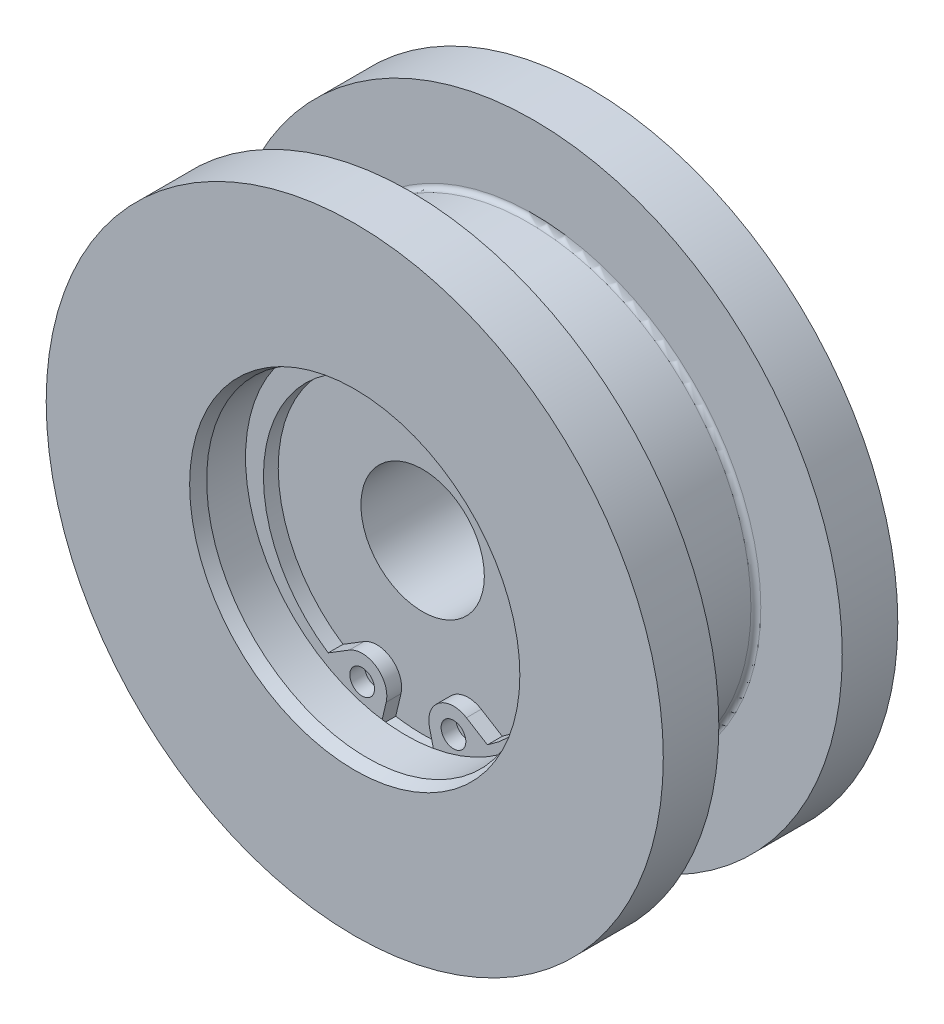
ISO-10303-21;
HEADER;
FILE_DESCRIPTION(('STEP AP214'),'2;1');
FILE_NAME('part.step','',(''),(''),'','','');
FILE_SCHEMA(('AUTOMOTIVE_DESIGN { 1 0 10303 214 1 1 1 1 }'));
ENDSEC;
DATA;
#1=APPLICATION_CONTEXT('core data for automotive mechanical design processes');
#2=APPLICATION_PROTOCOL_DEFINITION('international standard','automotive_design',2000,#1);
#3=PRODUCT_CONTEXT('',#1,'mechanical');
#4=PRODUCT('Part','Part','',(#3));
#5=PRODUCT_RELATED_PRODUCT_CATEGORY('part','',(#4));
#6=PRODUCT_DEFINITION_FORMATION('','',#4);
#7=PRODUCT_DEFINITION_CONTEXT('part definition',#1,'design');
#8=PRODUCT_DEFINITION('design','',#6,#7);
#9=PRODUCT_DEFINITION_SHAPE('','',#8);
#10=(LENGTH_UNIT() NAMED_UNIT(*) SI_UNIT(.MILLI.,.METRE.));
#11=(NAMED_UNIT(*) PLANE_ANGLE_UNIT() SI_UNIT($,.RADIAN.));
#12=(NAMED_UNIT(*) SI_UNIT($,.STERADIAN.) SOLID_ANGLE_UNIT());
#13=UNCERTAINTY_MEASURE_WITH_UNIT(LENGTH_MEASURE(1.E-05),#10,'distance_accuracy_value','');
#14=(GEOMETRIC_REPRESENTATION_CONTEXT(3) GLOBAL_UNCERTAINTY_ASSIGNED_CONTEXT((#13)) GLOBAL_UNIT_ASSIGNED_CONTEXT((#10,
#11,#12)) REPRESENTATION_CONTEXT('',''));
#15=CARTESIAN_POINT('',(0.,0.,0.));
#16=DIRECTION('',(0.,0.,1.));
#17=DIRECTION('',(1.,0.,0.));
#18=AXIS2_PLACEMENT_3D('',#15,#16,#17);
#19=CARTESIAN_POINT('',(0.,0.,-4.6));
#20=DIRECTION('',(0.,0.,1.));
#21=DIRECTION('',(0.,-1.,0.));
#22=AXIS2_PLACEMENT_3D('',#19,#20,#21);
#23=CYLINDRICAL_SURFACE('',#22,18.);
#24=CARTESIAN_POINT('',(0.,0.,4.6));
#25=DIRECTION('',(0.,0.,-1.));
#26=DIRECTION('',(-1.,0.,0.));
#27=AXIS2_PLACEMENT_3D('',#24,#25,#26);
#28=CIRCLE('',#27,18.);
#29=CARTESIAN_POINT('',(-18.,0.,4.6));
#30=VERTEX_POINT('',#29);
#31=EDGE_CURVE('E203',#30,#30,#28,.T.);
#32=ORIENTED_EDGE('',*,*,#31,.T.);
#33=EDGE_LOOP('',(#32));
#34=FACE_BOUND('',#33,.T.);
#35=CARTESIAN_POINT('',(0.,0.,-4.6));
#36=DIRECTION('',(0.,0.,1.));
#37=DIRECTION('',(1.,0.,0.));
#38=AXIS2_PLACEMENT_3D('',#35,#36,#37);
#39=CIRCLE('',#38,18.);
#40=CARTESIAN_POINT('',(18.,0.,-4.6));
#41=VERTEX_POINT('',#40);
#42=EDGE_CURVE('E199',#41,#41,#39,.T.);
#43=ORIENTED_EDGE('',*,*,#42,.T.);
#44=EDGE_LOOP('',(#43));
#45=FACE_BOUND('',#44,.T.);
#46=ADVANCED_FACE('F14',(#34,#45),#23,.T.);
#47=CARTESIAN_POINT('',(0.,0.,-4.6));
#48=DIRECTION('',(0.,0.,1.));
#49=DIRECTION('',(1.,0.,0.));
#50=AXIS2_PLACEMENT_3D('',#47,#48,#49);
#51=TOROIDAL_SURFACE('',#50,18.4,0.4);
#52=ORIENTED_EDGE('',*,*,#42,.F.);
#53=EDGE_LOOP('',(#52));
#54=FACE_BOUND('',#53,.T.);
#55=CARTESIAN_POINT('',(0.,0.,-5.));
#56=DIRECTION('',(0.,0.,1.));
#57=DIRECTION('',(1.,0.,0.));
#58=AXIS2_PLACEMENT_3D('',#55,#56,#57);
#59=CIRCLE('',#58,18.4);
#60=CARTESIAN_POINT('',(18.4,0.,-5.));
#61=VERTEX_POINT('',#60);
#62=EDGE_CURVE('E193',#61,#61,#59,.F.);
#63=ORIENTED_EDGE('',*,*,#62,.F.);
#64=EDGE_LOOP('',(#63));
#65=FACE_BOUND('',#64,.T.);
#66=ADVANCED_FACE('F266',(#54,#65),#51,.F.);
#67=CARTESIAN_POINT('',(0.,0.,4.6));
#68=DIRECTION('',(0.,0.,1.));
#69=DIRECTION('',(1.,0.,0.));
#70=AXIS2_PLACEMENT_3D('',#67,#68,#69);
#71=TOROIDAL_SURFACE('',#70,18.4,0.4);
#72=CARTESIAN_POINT('',(0.,0.,5.));
#73=DIRECTION('',(0.,0.,1.));
#74=DIRECTION('',(1.,0.,0.));
#75=AXIS2_PLACEMENT_3D('',#72,#73,#74);
#76=CIRCLE('',#75,18.4000000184);
#77=CARTESIAN_POINT('',(18.4000000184,0.,5.));
#78=VERTEX_POINT('',#77);
#79=EDGE_CURVE('E204',#78,#78,#76,.F.);
#80=ORIENTED_EDGE('',*,*,#79,.T.);
#81=EDGE_LOOP('',(#80));
#82=FACE_BOUND('',#81,.T.);
#83=ORIENTED_EDGE('',*,*,#31,.F.);
#84=EDGE_LOOP('',(#83));
#85=FACE_BOUND('',#84,.T.);
#86=ADVANCED_FACE('F260',(#82,#85),#71,.F.);
#87=CARTESIAN_POINT('',(25.3,-25.387056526,-5.));
#88=DIRECTION('',(0.,0.,-1.));
#89=DIRECTION('',(-1.,0.,0.));
#90=AXIS2_PLACEMENT_3D('',#87,#88,#89);
#91=PLANE('',#90);
#92=ORIENTED_EDGE('',*,*,#62,.T.);
#93=EDGE_LOOP('',(#92));
#94=FACE_BOUND('',#93,.T.);
#95=CARTESIAN_POINT('',(0.,0.,-5.));
#96=DIRECTION('',(0.,0.,1.));
#97=DIRECTION('',(1.,0.,0.));
#98=AXIS2_PLACEMENT_3D('',#95,#96,#97);
#99=CIRCLE('',#98,25.);
#100=CARTESIAN_POINT('',(25.,0.,-5.));
#101=VERTEX_POINT('',#100);
#102=EDGE_CURVE('E188',#101,#101,#99,.F.);
#103=ORIENTED_EDGE('',*,*,#102,.F.);
#104=EDGE_LOOP('',(#103));
#105=FACE_BOUND('',#104,.T.);
#106=ADVANCED_FACE('F249',(#94,#105),#91,.F.);
#107=CARTESIAN_POINT('',(-25.3,-25.387056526,5.));
#108=DIRECTION('',(0.,0.,1.));
#109=DIRECTION('',(1.,0.,0.));
#110=AXIS2_PLACEMENT_3D('',#107,#108,#109);
#111=PLANE('',#110);
#112=ORIENTED_EDGE('',*,*,#79,.F.);
#113=EDGE_LOOP('',(#112));
#114=FACE_BOUND('',#113,.T.);
#115=CARTESIAN_POINT('',(0.,0.,5.));
#116=DIRECTION('',(0.,0.,1.));
#117=DIRECTION('',(1.,0.,0.));
#118=AXIS2_PLACEMENT_3D('',#115,#116,#117);
#119=CIRCLE('',#118,25.);
#120=CARTESIAN_POINT('',(25.,0.,5.));
#121=VERTEX_POINT('',#120);
#122=EDGE_CURVE('E211',#121,#121,#119,.T.);
#123=ORIENTED_EDGE('',*,*,#122,.F.);
#124=EDGE_LOOP('',(#123));
#125=FACE_BOUND('',#124,.T.);
#126=ADVANCED_FACE('F247',(#114,#125),#111,.F.);
#127=CARTESIAN_POINT('',(0.,0.,-9.5));
#128=DIRECTION('',(0.,0.,1.));
#129=DIRECTION('',(1.,0.,0.));
#130=AXIS2_PLACEMENT_3D('',#127,#128,#129);
#131=CYLINDRICAL_SURFACE('',#130,25.);
#132=ORIENTED_EDGE('',*,*,#102,.T.);
#133=EDGE_LOOP('',(#132));
#134=FACE_BOUND('',#133,.T.);
#135=CARTESIAN_POINT('',(0.,0.,-9.5));
#136=DIRECTION('',(0.,0.,1.));
#137=DIRECTION('',(1.,0.,0.));
#138=AXIS2_PLACEMENT_3D('',#135,#136,#137);
#139=CIRCLE('',#138,25.);
#140=CARTESIAN_POINT('',(25.,0.,-9.5));
#141=VERTEX_POINT('',#140);
#142=EDGE_CURVE('E182',#141,#141,#139,.T.);
#143=ORIENTED_EDGE('',*,*,#142,.T.);
#144=EDGE_LOOP('',(#143));
#145=FACE_BOUND('',#144,.T.);
#146=ADVANCED_FACE('F243',(#134,#145),#131,.T.);
#147=CARTESIAN_POINT('',(0.,0.,5.));
#148=DIRECTION('',(0.,0.,1.));
#149=DIRECTION('',(1.,0.,0.));
#150=AXIS2_PLACEMENT_3D('',#147,#148,#149);
#151=CYLINDRICAL_SURFACE('',#150,25.);
#152=CARTESIAN_POINT('',(0.,0.,9.5));
#153=DIRECTION('',(0.,0.,1.));
#154=DIRECTION('',(1.,0.,0.));
#155=AXIS2_PLACEMENT_3D('',#152,#153,#154);
#156=CIRCLE('',#155,25.);
#157=CARTESIAN_POINT('',(25.,0.,9.5));
#158=VERTEX_POINT('',#157);
#159=EDGE_CURVE('E172',#158,#158,#156,.F.);
#160=ORIENTED_EDGE('',*,*,#159,.T.);
#161=EDGE_LOOP('',(#160));
#162=FACE_BOUND('',#161,.T.);
#163=ORIENTED_EDGE('',*,*,#122,.T.);
#164=EDGE_LOOP('',(#163));
#165=FACE_BOUND('',#164,.T.);
#166=ADVANCED_FACE('F240',(#162,#165),#151,.T.);
#167=CARTESIAN_POINT('',(-25.3,-25.387056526,-9.5));
#168=DIRECTION('',(0.,0.,1.));
#169=DIRECTION('',(1.,0.,0.));
#170=AXIS2_PLACEMENT_3D('',#167,#168,#169);
#171=PLANE('',#170);
#172=CARTESIAN_POINT('',(0.,0.,-9.5));
#173=DIRECTION('',(0.,0.,1.));
#174=DIRECTION('',(1.,0.,0.));
#175=AXIS2_PLACEMENT_3D('',#172,#173,#174);
#176=CIRCLE('',#175,11.);
#177=CARTESIAN_POINT('',(11.,0.,-9.5));
#178=VERTEX_POINT('',#177);
#179=EDGE_CURVE('E176',#178,#178,#176,.F.);
#180=ORIENTED_EDGE('',*,*,#179,.F.);
#181=EDGE_LOOP('',(#180));
#182=FACE_BOUND('',#181,.T.);
#183=ORIENTED_EDGE('',*,*,#142,.F.);
#184=EDGE_LOOP('',(#183));
#185=FACE_BOUND('',#184,.T.);
#186=ADVANCED_FACE('F236',(#182,#185),#171,.F.);
#187=CARTESIAN_POINT('',(25.3,-25.387056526,9.5));
#188=DIRECTION('',(0.,0.,-1.));
#189=DIRECTION('',(-1.,0.,0.));
#190=AXIS2_PLACEMENT_3D('',#187,#188,#189);
#191=PLANE('',#190);
#192=CARTESIAN_POINT('',(0.,0.,9.5));
#193=DIRECTION('',(0.,0.,1.));
#194=DIRECTION('',(1.,0.,0.));
#195=AXIS2_PLACEMENT_3D('',#192,#193,#194);
#196=CIRCLE('',#195,13.377350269);
#197=CARTESIAN_POINT('',(13.377350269,0.,9.5));
#198=VERTEX_POINT('',#197);
#199=EDGE_CURVE('E207',#198,#198,#196,.T.);
#200=ORIENTED_EDGE('',*,*,#199,.F.);
#201=EDGE_LOOP('',(#200));
#202=FACE_BOUND('',#201,.T.);
#203=ORIENTED_EDGE('',*,*,#159,.F.);
#204=EDGE_LOOP('',(#203));
#205=FACE_BOUND('',#204,.T.);
#206=ADVANCED_FACE('F233',(#202,#205),#191,.F.);
#207=CARTESIAN_POINT('',(0.,0.,-9.5));
#208=DIRECTION('',(0.,0.,1.));
#209=DIRECTION('',(1.,0.,0.));
#210=AXIS2_PLACEMENT_3D('',#207,#208,#209);
#211=CYLINDRICAL_SURFACE('',#210,11.);
#212=ORIENTED_EDGE('',*,*,#179,.T.);
#213=EDGE_LOOP('',(#212));
#214=FACE_BOUND('',#213,.T.);
#215=CARTESIAN_POINT('',(0.,0.,-4.));
#216=DIRECTION('',(0.,0.,1.));
#217=DIRECTION('',(1.,0.,0.));
#218=AXIS2_PLACEMENT_3D('',#215,#216,#217);
#219=CIRCLE('',#218,11.);
#220=CARTESIAN_POINT('',(11.,0.,-4.));
#221=VERTEX_POINT('',#220);
#222=EDGE_CURVE('E173',#221,#221,#219,.T.);
#223=ORIENTED_EDGE('',*,*,#222,.T.);
#224=EDGE_LOOP('',(#223));
#225=FACE_BOUND('',#224,.T.);
#226=ADVANCED_FACE('F229',(#214,#225),#211,.F.);
#227=CARTESIAN_POINT('',(0.,0.,8.5));
#228=DIRECTION('',(0.,0.,1.));
#229=DIRECTION('',(1.,0.,0.));
#230=AXIS2_PLACEMENT_3D('',#227,#228,#229);
#231=CONICAL_SURFACE('',#230,13.,0.360829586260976);
#232=CARTESIAN_POINT('',(0.,0.,8.5));
#233=DIRECTION('',(0.,0.,1.));
#234=DIRECTION('',(1.,0.,0.));
#235=AXIS2_PLACEMENT_3D('',#232,#233,#234);
#236=CIRCLE('',#235,13.);
#237=CARTESIAN_POINT('',(13.,0.,8.49999999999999));
#238=VERTEX_POINT('',#237);
#239=EDGE_CURVE('E208',#238,#238,#236,.T.);
#240=ORIENTED_EDGE('',*,*,#239,.F.);
#241=EDGE_LOOP('',(#240));
#242=FACE_BOUND('',#241,.T.);
#243=ORIENTED_EDGE('',*,*,#199,.T.);
#244=EDGE_LOOP('',(#243));
#245=FACE_BOUND('',#244,.T.);
#246=ADVANCED_FACE('F225',(#242,#245),#231,.F.);
#247=CARTESIAN_POINT('',(-11.132,-11.170304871,-4.));
#248=DIRECTION('',(0.,0.,1.));
#249=DIRECTION('',(1.,0.,0.));
#250=AXIS2_PLACEMENT_3D('',#247,#248,#249);
#251=PLANE('',#250);
#252=CARTESIAN_POINT('',(0.,0.,-4.));
#253=DIRECTION('',(0.,0.,1.));
#254=DIRECTION('',(1.,0.,0.));
#255=AXIS2_PLACEMENT_3D('',#252,#253,#254);
#256=CIRCLE('',#255,5.);
#257=CARTESIAN_POINT('',(5.,0.,-4.));
#258=VERTEX_POINT('',#257);
#259=EDGE_CURVE('E179',#258,#258,#256,.T.);
#260=ORIENTED_EDGE('',*,*,#259,.T.);
#261=EDGE_LOOP('',(#260));
#262=FACE_BOUND('',#261,.T.);
#263=ORIENTED_EDGE('',*,*,#222,.F.);
#264=EDGE_LOOP('',(#263));
#265=FACE_BOUND('',#264,.T.);
#266=ADVANCED_FACE('F228',(#262,#265),#251,.F.);
#267=CARTESIAN_POINT('',(0.,0.,5.35));
#268=DIRECTION('',(0.,0.,1.));
#269=DIRECTION('',(1.,0.,0.));
#270=AXIS2_PLACEMENT_3D('',#267,#268,#269);
#271=CYLINDRICAL_SURFACE('',#270,13.);
#272=CARTESIAN_POINT('',(0.,0.,5.35));
#273=DIRECTION('',(0.,0.,1.));
#274=DIRECTION('',(1.,0.,0.));
#275=AXIS2_PLACEMENT_3D('',#272,#273,#274);
#276=CIRCLE('',#275,13.);
#277=CARTESIAN_POINT('',(13.,0.,5.35));
#278=VERTEX_POINT('',#277);
#279=EDGE_CURVE('E200',#278,#278,#276,.T.);
#280=ORIENTED_EDGE('',*,*,#279,.F.);
#281=EDGE_LOOP('',(#280));
#282=FACE_BOUND('',#281,.T.);
#283=ORIENTED_EDGE('',*,*,#239,.T.);
#284=EDGE_LOOP('',(#283));
#285=FACE_BOUND('',#284,.T.);
#286=ADVANCED_FACE('F223',(#282,#285),#271,.F.);
#287=CARTESIAN_POINT('',(0.,0.,-4.));
#288=DIRECTION('',(0.,0.,1.));
#289=DIRECTION('',(1.,0.,0.));
#290=AXIS2_PLACEMENT_3D('',#287,#288,#289);
#291=CYLINDRICAL_SURFACE('',#290,5.);
#292=ORIENTED_EDGE('',*,*,#259,.F.);
#293=EDGE_LOOP('',(#292));
#294=FACE_BOUND('',#293,.T.);
#295=CARTESIAN_POINT('',(0.,0.,4.));
#296=DIRECTION('',(0.,0.,1.));
#297=DIRECTION('',(1.,0.,0.));
#298=AXIS2_PLACEMENT_3D('',#295,#296,#297);
#299=CIRCLE('',#298,5.);
#300=CARTESIAN_POINT('',(5.,0.,4.));
#301=VERTEX_POINT('',#300);
#302=EDGE_CURVE('E185',#301,#301,#299,.T.);
#303=ORIENTED_EDGE('',*,*,#302,.T.);
#304=EDGE_LOOP('',(#303));
#305=FACE_BOUND('',#304,.T.);
#306=ADVANCED_FACE('F280',(#294,#305),#291,.F.);
#307=CARTESIAN_POINT('',(13.7632,-13.81055875,4.));
#308=DIRECTION('',(0.,0.,-1.));
#309=DIRECTION('',(-1.,0.,0.));
#310=AXIS2_PLACEMENT_3D('',#307,#308,#309);
#311=PLANE('',#310);
#312=ORIENTED_EDGE('',*,*,#302,.F.);
#313=EDGE_LOOP('',(#312));
#314=FACE_BOUND('',#313,.T.);
#315=DIRECTION('',(0.231349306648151,-0.972870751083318,0.));
#316=VECTOR('',#315,1.);
#317=CARTESIAN_POINT('',(2.88824186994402,-16.3966309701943,4.));
#318=LINE('',#317,#316);
#319=CARTESIAN_POINT('',(1.75425849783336,-11.6280009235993,4.));
#320=VERTEX_POINT('',#319);
#321=CARTESIAN_POINT('',(2.1813307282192,-13.4239262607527,4.));
#322=VERTEX_POINT('',#321);
#323=EDGE_CURVE('E9',#320,#322,#318,.T.);
#324=ORIENTED_EDGE('',*,*,#323,.F.);
#325=CARTESIAN_POINT('',(3.7,-11.165302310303,4.));
#326=DIRECTION('',(0.,0.,-1.));
#327=DIRECTION('',(-1.,0.,0.));
#328=AXIS2_PLACEMENT_3D('',#325,#326,#327);
#329=CIRCLE('',#328,2.);
#330=CARTESIAN_POINT('',(4.74866968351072,-9.46227797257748,4.));
#331=VERTEX_POINT('',#330);
#332=EDGE_CURVE('E25',#320,#331,#329,.T.);
#333=ORIENTED_EDGE('',*,*,#332,.T.);
#334=DIRECTION('',(-0.851512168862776,0.524334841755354,0.));
#335=VECTOR('',#334,1.);
#336=CARTESIAN_POINT('',(13.2262715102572,-14.6825228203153,4.));
#337=LINE('',#336,#335);
#338=CARTESIAN_POINT('',(6.45127454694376,-10.5106893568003,4.));
#339=VERTEX_POINT('',#338);
#340=EDGE_CURVE('E141',#339,#331,#337,.T.);
#341=ORIENTED_EDGE('',*,*,#340,.F.);
#342=CARTESIAN_POINT('',(0.,-0.75,4.));
#343=DIRECTION('',(0.,0.,-1.));
#344=DIRECTION('',(-1.,0.,0.));
#345=AXIS2_PLACEMENT_3D('',#342,#343,#344);
#346=CIRCLE('',#345,11.7);
#347=CARTESIAN_POINT('',(-6.45127454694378,-10.5106893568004,4.));
#348=VERTEX_POINT('',#347);
#349=EDGE_CURVE('E144',#348,#339,#346,.T.);
#350=ORIENTED_EDGE('',*,*,#349,.F.);
#351=DIRECTION('',(-0.851512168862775,-0.524334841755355,0.));
#352=VECTOR('',#351,1.);
#353=CARTESIAN_POINT('',(6.73237719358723,-2.39260461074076,4.));
#354=LINE('',#353,#352);
#355=CARTESIAN_POINT('',(-4.74866968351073,-9.46227797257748,4.));
#356=VERTEX_POINT('',#355);
#357=EDGE_CURVE('E148',#356,#348,#354,.T.);
#358=ORIENTED_EDGE('',*,*,#357,.F.);
#359=CARTESIAN_POINT('',(-3.7,-11.165302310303,4.));
#360=DIRECTION('',(0.,0.,-1.));
#361=DIRECTION('',(-1.,0.,0.));
#362=AXIS2_PLACEMENT_3D('',#359,#360,#361);
#363=CIRCLE('',#362,2.);
#364=CARTESIAN_POINT('',(-1.75425849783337,-11.6280009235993,4.));
#365=VERTEX_POINT('',#364);
#366=EDGE_CURVE('E155',#356,#365,#363,.T.);
#367=ORIENTED_EDGE('',*,*,#366,.T.);
#368=DIRECTION('',(0.231349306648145,0.97287075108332,0.));
#369=VECTOR('',#368,1.);
#370=CARTESIAN_POINT('',(-1.41496007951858,-10.2011822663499,4.));
#371=LINE('',#370,#369);
#372=CARTESIAN_POINT('',(-2.18133072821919,-13.4239262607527,4.));
#373=VERTEX_POINT('',#372);
#374=EDGE_CURVE('E152',#373,#365,#371,.T.);
#375=ORIENTED_EDGE('',*,*,#374,.F.);
#376=CARTESIAN_POINT('',(0.,0.,4.));
#377=DIRECTION('',(0.,0.,1.));
#378=DIRECTION('',(0.,-1.,0.));
#379=AXIS2_PLACEMENT_3D('',#376,#377,#378);
#380=CIRCLE('',#379,13.6);
#381=EDGE_CURVE('E191',#373,#322,#380,.T.);
#382=ORIENTED_EDGE('',*,*,#381,.T.);
#383=EDGE_LOOP('',(#324,#333,#341,#350,#358,#367,#375,#382));
#384=FACE_BOUND('',#383,.T.);
#385=ADVANCED_FACE('F289',(#314,#384),#311,.F.);
#386=CARTESIAN_POINT('',(-13.7632,-13.81055875,5.35));
#387=DIRECTION('',(0.,0.,1.));
#388=DIRECTION('',(1.,0.,0.));
#389=AXIS2_PLACEMENT_3D('',#386,#387,#388);
#390=PLANE('',#389);
#391=ORIENTED_EDGE('',*,*,#279,.T.);
#392=EDGE_LOOP('',(#391));
#393=FACE_BOUND('',#392,.T.);
#394=CARTESIAN_POINT('',(0.,0.,5.35));
#395=DIRECTION('',(0.,0.,1.));
#396=DIRECTION('',(0.,-1.,0.));
#397=AXIS2_PLACEMENT_3D('',#394,#395,#396);
#398=CIRCLE('',#397,13.6);
#399=CARTESIAN_POINT('',(0.,-13.6,5.35));
#400=VERTEX_POINT('',#399);
#401=EDGE_CURVE('E196',#400,#400,#398,.T.);
#402=ORIENTED_EDGE('',*,*,#401,.F.);
#403=EDGE_LOOP('',(#402));
#404=FACE_BOUND('',#403,.T.);
#405=ADVANCED_FACE('F291',(#393,#404),#390,.F.);
#406=CARTESIAN_POINT('',(0.,0.,4.));
#407=DIRECTION('',(0.,0.,1.));
#408=DIRECTION('',(0.,-1.,0.));
#409=AXIS2_PLACEMENT_3D('',#406,#407,#408);
#410=CYLINDRICAL_SURFACE('',#409,13.6);
#411=ORIENTED_EDGE('',*,*,#401,.T.);
#412=EDGE_LOOP('',(#411));
#413=FACE_BOUND('',#412,.T.);
#414=CARTESIAN_POINT('',(0.,0.,5.2));
#415=DIRECTION('',(0.,0.,-1.));
#416=DIRECTION('',(-1.,0.,0.));
#417=AXIS2_PLACEMENT_3D('',#414,#415,#416);
#418=CIRCLE('',#417,13.6);
#419=CARTESIAN_POINT('',(-2.18133072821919,-13.4239262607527,5.2));
#420=VERTEX_POINT('',#419);
#421=CARTESIAN_POINT('',(2.1813307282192,-13.4239262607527,5.2));
#422=VERTEX_POINT('',#421);
#423=EDGE_CURVE('E167',#420,#422,#418,.T.);
#424=ORIENTED_EDGE('',*,*,#423,.T.);
#425=DIRECTION('',(0.,0.,1.));
#426=VECTOR('',#425,1.);
#427=CARTESIAN_POINT('',(2.1813307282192,-13.4239262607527,4.));
#428=LINE('',#427,#426);
#429=EDGE_CURVE('E85',#422,#322,#428,.F.);
#430=ORIENTED_EDGE('',*,*,#429,.T.);
#431=ORIENTED_EDGE('',*,*,#381,.F.);
#432=DIRECTION('',(0.,0.,1.));
#433=VECTOR('',#432,1.);
#434=CARTESIAN_POINT('',(-2.18133072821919,-13.4239262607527,4.));
#435=LINE('',#434,#433);
#436=EDGE_CURVE('E169',#373,#420,#435,.T.);
#437=ORIENTED_EDGE('',*,*,#436,.T.);
#438=EDGE_LOOP('',(#424,#430,#431,#437));
#439=FACE_BOUND('',#438,.T.);
#440=ADVANCED_FACE('F278',(#413,#439),#410,.F.);
#441=CARTESIAN_POINT('',(3.7,-11.165302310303,4.));
#442=DIRECTION('',(0.,0.,-1.));
#443=DIRECTION('',(-1.,0.,0.));
#444=AXIS2_PLACEMENT_3D('',#441,#442,#443);
#445=CIRCLE('',#444,1.);
#446=CARTESIAN_POINT('',(2.7,-11.165302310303,4.));
#447=VERTEX_POINT('',#446);
#448=EDGE_CURVE('E163',#447,#447,#445,.T.);
#449=ORIENTED_EDGE('',*,*,#448,.F.);
#450=EDGE_LOOP('',(#449));
#451=FACE_BOUND('',#450,.T.);
#452=ADVANCED_FACE('F294',(#451),#311,.F.);
#453=CARTESIAN_POINT('',(-3.7,-11.165302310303,4.));
#454=DIRECTION('',(0.,0.,-1.));
#455=DIRECTION('',(-1.,0.,0.));
#456=AXIS2_PLACEMENT_3D('',#453,#454,#455);
#457=CIRCLE('',#456,1.);
#458=CARTESIAN_POINT('',(-4.7,-11.165302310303,4.));
#459=VERTEX_POINT('',#458);
#460=EDGE_CURVE('E159',#459,#459,#457,.T.);
#461=ORIENTED_EDGE('',*,*,#460,.F.);
#462=EDGE_LOOP('',(#461));
#463=FACE_BOUND('',#462,.T.);
#464=ADVANCED_FACE('F293',(#463),#311,.F.);
#465=CARTESIAN_POINT('',(4.74866968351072,-9.46227797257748,5.2));
#466=DIRECTION('',(-0.524334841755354,-0.851512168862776,0.));
#467=DIRECTION('',(-0.851512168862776,0.524334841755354,0.));
#468=AXIS2_PLACEMENT_3D('',#465,#466,#467);
#469=PLANE('',#468);
#470=ORIENTED_EDGE('',*,*,#340,.T.);
#471=DIRECTION('',(0.,0.,-1.));
#472=VECTOR('',#471,1.);
#473=CARTESIAN_POINT('',(4.74866968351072,-9.46227797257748,5.2));
#474=LINE('',#473,#472);
#475=CARTESIAN_POINT('',(4.74866968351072,-9.46227797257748,5.2));
#476=VERTEX_POINT('',#475);
#477=EDGE_CURVE('E101',#476,#331,#474,.T.);
#478=ORIENTED_EDGE('',*,*,#477,.F.);
#479=DIRECTION('',(-0.851512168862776,0.524334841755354,0.));
#480=VECTOR('',#479,1.);
#481=CARTESIAN_POINT('',(4.74866968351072,-9.46227797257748,5.2));
#482=LINE('',#481,#480);
#483=CARTESIAN_POINT('',(6.45127454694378,-10.5106893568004,5.2));
#484=VERTEX_POINT('',#483);
#485=EDGE_CURVE('E94',#484,#476,#482,.T.);
#486=ORIENTED_EDGE('',*,*,#485,.F.);
#487=DIRECTION('',(0.,0.,-1.));
#488=VECTOR('',#487,1.);
#489=CARTESIAN_POINT('',(6.45127454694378,-10.5106893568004,5.2));
#490=LINE('',#489,#488);
#491=EDGE_CURVE('E125',#484,#339,#490,.T.);
#492=ORIENTED_EDGE('',*,*,#491,.T.);
#493=EDGE_LOOP('',(#470,#478,#486,#492));
#494=FACE_BOUND('',#493,.T.);
#495=ADVANCED_FACE('F389',(#494),#469,.F.);
#496=CARTESIAN_POINT('',(0.,-0.75,5.2));
#497=DIRECTION('',(0.,0.,1.));
#498=DIRECTION('',(-1.,0.,0.));
#499=AXIS2_PLACEMENT_3D('',#496,#497,#498);
#500=CYLINDRICAL_SURFACE('',#499,11.7);
#501=ORIENTED_EDGE('',*,*,#349,.T.);
#502=ORIENTED_EDGE('',*,*,#491,.F.);
#503=CARTESIAN_POINT('',(0.,-0.75,5.2));
#504=DIRECTION('',(0.,0.,-1.));
#505=DIRECTION('',(0.,-1.,0.));
#506=AXIS2_PLACEMENT_3D('',#503,#504,#505);
#507=CIRCLE('',#506,11.7);
#508=CARTESIAN_POINT('',(-6.45127454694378,-10.5106893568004,5.2));
#509=VERTEX_POINT('',#508);
#510=EDGE_CURVE('E128',#509,#484,#507,.T.);
#511=ORIENTED_EDGE('',*,*,#510,.F.);
#512=DIRECTION('',(0.,0.,-1.));
#513=VECTOR('',#512,1.);
#514=CARTESIAN_POINT('',(-6.45127454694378,-10.5106893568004,5.2));
#515=LINE('',#514,#513);
#516=EDGE_CURVE('E121',#509,#348,#515,.T.);
#517=ORIENTED_EDGE('',*,*,#516,.T.);
#518=EDGE_LOOP('',(#501,#502,#511,#517));
#519=FACE_BOUND('',#518,.T.);
#520=ADVANCED_FACE('F16',(#519),#500,.F.);
#521=CARTESIAN_POINT('',(-4.74866968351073,-9.46227797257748,5.2));
#522=DIRECTION('',(0.524334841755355,-0.851512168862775,0.));
#523=DIRECTION('',(0.,0.,-1.));
#524=AXIS2_PLACEMENT_3D('',#521,#522,#523);
#525=PLANE('',#524);
#526=ORIENTED_EDGE('',*,*,#357,.T.);
#527=ORIENTED_EDGE('',*,*,#516,.F.);
#528=DIRECTION('',(-0.851512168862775,-0.524334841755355,0.));
#529=VECTOR('',#528,1.);
#530=CARTESIAN_POINT('',(-4.74866968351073,-9.46227797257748,5.2));
#531=LINE('',#530,#529);
#532=CARTESIAN_POINT('',(-4.74866968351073,-9.46227797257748,5.2));
#533=VERTEX_POINT('',#532);
#534=EDGE_CURVE('E129',#533,#509,#531,.T.);
#535=ORIENTED_EDGE('',*,*,#534,.F.);
#536=DIRECTION('',(0.,0.,-1.));
#537=VECTOR('',#536,1.);
#538=CARTESIAN_POINT('',(-4.74866968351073,-9.46227797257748,5.2));
#539=LINE('',#538,#537);
#540=EDGE_CURVE('E18',#533,#356,#539,.T.);
#541=ORIENTED_EDGE('',*,*,#540,.T.);
#542=EDGE_LOOP('',(#526,#527,#535,#541));
#543=FACE_BOUND('',#542,.T.);
#544=ADVANCED_FACE('F405',(#543),#525,.F.);
#545=CARTESIAN_POINT('',(-3.7,-11.165302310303,5.2));
#546=DIRECTION('',(0.,0.,1.));
#547=DIRECTION('',(-1.,0.,0.));
#548=AXIS2_PLACEMENT_3D('',#545,#546,#547);
#549=CYLINDRICAL_SURFACE('',#548,1.);
#550=ORIENTED_EDGE('',*,*,#460,.T.);
#551=EDGE_LOOP('',(#550));
#552=FACE_BOUND('',#551,.T.);
#553=CARTESIAN_POINT('',(-3.7,-11.165302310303,5.2));
#554=DIRECTION('',(0.,0.,-1.));
#555=DIRECTION('',(1.,0.,0.));
#556=AXIS2_PLACEMENT_3D('',#553,#554,#555);
#557=CIRCLE('',#556,1.);
#558=CARTESIAN_POINT('',(-2.7,-11.165302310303,5.2));
#559=VERTEX_POINT('',#558);
#560=EDGE_CURVE('E106',#559,#559,#557,.T.);
#561=ORIENTED_EDGE('',*,*,#560,.F.);
#562=EDGE_LOOP('',(#561));
#563=FACE_BOUND('',#562,.T.);
#564=ADVANCED_FACE('F413',(#552,#563),#549,.F.);
#565=CARTESIAN_POINT('',(3.7,-11.165302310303,5.2));
#566=DIRECTION('',(0.,0.,1.));
#567=DIRECTION('',(-1.,0.,0.));
#568=AXIS2_PLACEMENT_3D('',#565,#566,#567);
#569=CYLINDRICAL_SURFACE('',#568,1.);
#570=ORIENTED_EDGE('',*,*,#448,.T.);
#571=EDGE_LOOP('',(#570));
#572=FACE_BOUND('',#571,.T.);
#573=CARTESIAN_POINT('',(3.7,-11.165302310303,5.2));
#574=DIRECTION('',(0.,0.,1.));
#575=DIRECTION('',(1.,0.,0.));
#576=AXIS2_PLACEMENT_3D('',#573,#574,#575);
#577=CIRCLE('',#576,1.);
#578=CARTESIAN_POINT('',(4.7,-11.165302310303,5.2));
#579=VERTEX_POINT('',#578);
#580=EDGE_CURVE('E109',#579,#579,#577,.T.);
#581=ORIENTED_EDGE('',*,*,#580,.T.);
#582=EDGE_LOOP('',(#581));
#583=FACE_BOUND('',#582,.T.);
#584=ADVANCED_FACE('F382',(#572,#583),#569,.F.);
#585=CARTESIAN_POINT('',(3.7,-11.165302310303,5.2));
#586=DIRECTION('',(0.,0.,1.));
#587=DIRECTION('',(-1.,0.,0.));
#588=AXIS2_PLACEMENT_3D('',#585,#586,#587);
#589=CYLINDRICAL_SURFACE('',#588,2.);
#590=ORIENTED_EDGE('',*,*,#332,.F.);
#591=DIRECTION('',(0.,0.,-1.));
#592=VECTOR('',#591,1.);
#593=CARTESIAN_POINT('',(1.75425849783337,-11.6280009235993,5.2));
#594=LINE('',#593,#592);
#595=CARTESIAN_POINT('',(1.75425849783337,-11.6280009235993,5.2));
#596=VERTEX_POINT('',#595);
#597=EDGE_CURVE('E82',#596,#320,#594,.T.);
#598=ORIENTED_EDGE('',*,*,#597,.F.);
#599=CARTESIAN_POINT('',(3.7,-11.165302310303,5.2));
#600=DIRECTION('',(0.,0.,1.));
#601=DIRECTION('',(1.,0.,0.));
#602=AXIS2_PLACEMENT_3D('',#599,#600,#601);
#603=CIRCLE('',#602,2.);
#604=EDGE_CURVE('E88',#476,#596,#603,.T.);
#605=ORIENTED_EDGE('',*,*,#604,.F.);
#606=ORIENTED_EDGE('',*,*,#477,.T.);
#607=EDGE_LOOP('',(#590,#598,#605,#606));
#608=FACE_BOUND('',#607,.T.);
#609=ADVANCED_FACE('F99',(#608),#589,.T.);
#610=CARTESIAN_POINT('',(0.,-0.75,5.2));
#611=DIRECTION('',(0.,0.,-1.));
#612=DIRECTION('',(0.,-1.,0.));
#613=AXIS2_PLACEMENT_3D('',#610,#611,#612);
#614=PLANE('',#613);
#615=ORIENTED_EDGE('',*,*,#580,.F.);
#616=EDGE_LOOP('',(#615));
#617=FACE_BOUND('',#616,.T.);
#618=ORIENTED_EDGE('',*,*,#560,.T.);
#619=EDGE_LOOP('',(#618));
#620=FACE_BOUND('',#619,.T.);
#621=ORIENTED_EDGE('',*,*,#423,.F.);
#622=DIRECTION('',(0.231349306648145,0.97287075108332,0.));
#623=VECTOR('',#622,1.);
#624=CARTESIAN_POINT('',(-1.75425849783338,-11.6280009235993,5.2));
#625=LINE('',#624,#623);
#626=CARTESIAN_POINT('',(-1.75425849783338,-11.6280009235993,5.2));
#627=VERTEX_POINT('',#626);
#628=EDGE_CURVE('E70',#420,#627,#625,.T.);
#629=ORIENTED_EDGE('',*,*,#628,.T.);
#630=CARTESIAN_POINT('',(-3.7,-11.165302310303,5.2));
#631=DIRECTION('',(0.,0.,1.));
#632=DIRECTION('',(-1.,0.,0.));
#633=AXIS2_PLACEMENT_3D('',#630,#631,#632);
#634=CIRCLE('',#633,2.);
#635=EDGE_CURVE('E114',#627,#533,#634,.T.);
#636=ORIENTED_EDGE('',*,*,#635,.T.);
#637=ORIENTED_EDGE('',*,*,#534,.T.);
#638=ORIENTED_EDGE('',*,*,#510,.T.);
#639=ORIENTED_EDGE('',*,*,#485,.T.);
#640=ORIENTED_EDGE('',*,*,#604,.T.);
#641=DIRECTION('',(0.231349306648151,-0.972870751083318,0.));
#642=VECTOR('',#641,1.);
#643=CARTESIAN_POINT('',(1.75425849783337,-11.6280009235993,5.2));
#644=LINE('',#643,#642);
#645=EDGE_CURVE('E78',#596,#422,#644,.T.);
#646=ORIENTED_EDGE('',*,*,#645,.T.);
#647=EDGE_LOOP('',(#621,#629,#636,#637,#638,#639,#640,#646));
#648=FACE_BOUND('',#647,.T.);
#649=ADVANCED_FACE('F92',(#617,#620,#648),#614,.F.);
#650=CARTESIAN_POINT('',(-3.7,-11.165302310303,5.2));
#651=DIRECTION('',(0.,0.,1.));
#652=DIRECTION('',(-1.,0.,0.));
#653=AXIS2_PLACEMENT_3D('',#650,#651,#652);
#654=CYLINDRICAL_SURFACE('',#653,2.);
#655=ORIENTED_EDGE('',*,*,#366,.F.);
#656=ORIENTED_EDGE('',*,*,#540,.F.);
#657=ORIENTED_EDGE('',*,*,#635,.F.);
#658=DIRECTION('',(0.,0.,-1.));
#659=VECTOR('',#658,1.);
#660=CARTESIAN_POINT('',(-1.75425849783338,-11.6280009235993,5.2));
#661=LINE('',#660,#659);
#662=EDGE_CURVE('E102',#627,#365,#661,.T.);
#663=ORIENTED_EDGE('',*,*,#662,.T.);
#664=EDGE_LOOP('',(#655,#656,#657,#663));
#665=FACE_BOUND('',#664,.T.);
#666=ADVANCED_FACE('F424',(#665),#654,.T.);
#667=CARTESIAN_POINT('',(-1.75425849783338,-11.6280009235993,5.2));
#668=DIRECTION('',(-0.97287075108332,0.231349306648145,0.));
#669=DIRECTION('',(0.,0.,1.));
#670=AXIS2_PLACEMENT_3D('',#667,#668,#669);
#671=PLANE('',#670);
#672=ORIENTED_EDGE('',*,*,#436,.F.);
#673=ORIENTED_EDGE('',*,*,#374,.T.);
#674=ORIENTED_EDGE('',*,*,#662,.F.);
#675=ORIENTED_EDGE('',*,*,#628,.F.);
#676=EDGE_LOOP('',(#672,#673,#674,#675));
#677=FACE_BOUND('',#676,.T.);
#678=ADVANCED_FACE('F453',(#677),#671,.F.);
#679=CARTESIAN_POINT('',(1.75425849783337,-11.6280009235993,5.2));
#680=DIRECTION('',(0.972870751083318,0.231349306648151,0.));
#681=DIRECTION('',(0.,0.,-1.));
#682=AXIS2_PLACEMENT_3D('',#679,#680,#681);
#683=PLANE('',#682);
#684=ORIENTED_EDGE('',*,*,#429,.F.);
#685=ORIENTED_EDGE('',*,*,#645,.F.);
#686=ORIENTED_EDGE('',*,*,#597,.T.);
#687=ORIENTED_EDGE('',*,*,#323,.T.);
#688=EDGE_LOOP('',(#684,#685,#686,#687));
#689=FACE_BOUND('',#688,.T.);
#690=ADVANCED_FACE('F80',(#689),#683,.F.);
#691=CLOSED_SHELL('',(#46,#66,#86,#106,#126,#146,#166,#186,#206,#226,#246,#266,#286,#306,#385,
#405,#440,#452,#464,#495,#520,#544,#564,#584,#609,#649,#666,#678,#690));
#692=MANIFOLD_SOLID_BREP('B1',#691);
#693=ADVANCED_BREP_SHAPE_REPRESENTATION('',(#18,#692),#14);
#694=SHAPE_DEFINITION_REPRESENTATION(#9,#693);
ENDSEC;
END-ISO-10303-21;
